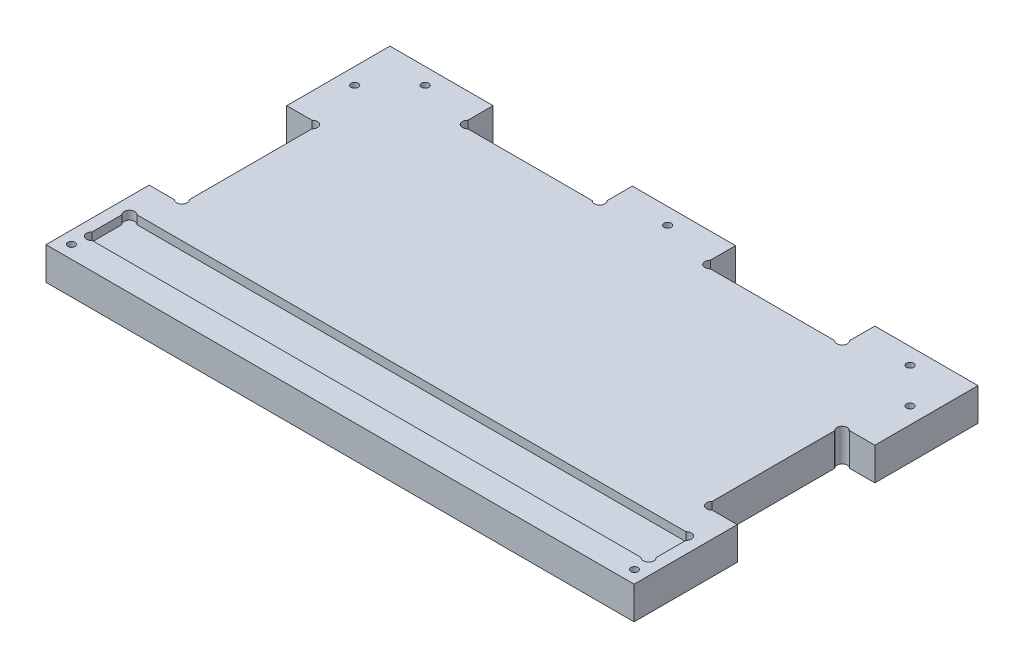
from build123d import *

# Parameters (mm, degrees)
ESQUISSE1_R        = 2.1
BOSS_EXTRU_1_DEPTH = 19
ESQUISSE2_W        = 333.917279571
ESQUISSE2_H        = 33.62448748
BOSS_EXTRU_2_DEPTH = 14


with BuildPart() as part:
    # Esquisse1 → Boss.-Extru.1 (new body)
    with BuildSketch(Plane(origin=(0, 0, 0), x_dir=(1, 0, 0), z_dir=(0, 1, 0))):
        with BuildLine():
            Line((0, 0), (342, 0))
            Line((342, 0), (342, 60))
            Line((342, 60), (327.311899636, 60))
            ThreePointArc((327.311899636, 60), (322.943324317, 59.943324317), (323, 64.311899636))
            Line((323, 64.311899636), (323, 135.688100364))
            ThreePointArc((323, 135.688100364), (322.943324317, 140.056675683), (327.311899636, 140))
            Line((327.311899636, 140), (342, 140))
            Line((342, 140), (342, 200))
            Line((342, 200), (282, 200))
            Line((282, 200), (282, 185.311899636))
            ThreePointArc((282, 185.311899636), (282.056675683, 180.943324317), (277.688100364, 181))
            Line((277.688100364, 181), (205.311899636, 181))
            ThreePointArc((205.311899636, 181), (200.943324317, 180.943324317), (201, 185.311899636))
            Line((201, 185.311899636), (201, 200))
            Line((201, 200), (141, 200))
            Line((141, 200), (141, 185.311899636))
            ThreePointArc((141, 185.311899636), (141.056675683, 180.943324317), (136.688100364, 181))
            Line((136.688100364, 181), (64.311899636, 181))
            ThreePointArc((64.311899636, 181), (59.943324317, 180.943324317), (60, 185.311899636))
            Line((60, 185.311899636), (60, 200))
            Line((60, 200), (0, 200))
            Line((0, 200), (0, 140))
            Line((0, 140), (14.688100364, 140))
            ThreePointArc((14.688100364, 140), (19.056675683, 140.056675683), (19, 135.688100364))
            Line((19, 135.688100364), (19, 64.311899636))
            ThreePointArc((19, 64.311899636), (19.056675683, 59.943324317), (14.688100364, 60))
            Line((14.688100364, 60), (0, 60))
            Line((0, 60), (0, 0))
        make_face()
        with Locations(Location((334.75, 7.5, 0), (0, 0, 270))):
            Circle(ESQUISSE1_R, mode=Mode.SUBTRACT)
        with Locations(Location((7.25, 7.5, 0), (0, 0, 90))):
            Circle(ESQUISSE1_R, mode=Mode.SUBTRACT)
        with Locations(Location((9.5, 170, 0), (0, 0, 270))):
            Circle(ESQUISSE1_R, mode=Mode.SUBTRACT)
        with Locations(Location((30, 190.5, 0), (0, 0, 270))):
            Circle(ESQUISSE1_R, mode=Mode.SUBTRACT)
        with Locations(Location((171, 190.5, 0), (0, 0, 270))):
            Circle(ESQUISSE1_R, mode=Mode.SUBTRACT)
        with Locations(Location((312, 190.5, 0), (0, 0, 90))):
            Circle(ESQUISSE1_R, mode=Mode.SUBTRACT)
        with Locations(Location((332.5, 170, 0), (0, 0, 90))):
            Circle(ESQUISSE1_R, mode=Mode.SUBTRACT)
        with BuildLine():
            Line((11.38035085, 41.5), (330.61964915, 41.5))
            ThreePointArc((330.61964915, 41.5), (335.092031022, 41.592031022), (335, 37.11964915))
            Line((335, 37.11964915), (335, 19.88035085))
            ThreePointArc((335, 19.88035085), (335.092031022, 15.407968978), (330.61964915, 15.5))
            Line((330.61964915, 15.5), (11.38035085, 15.5))
            ThreePointArc((11.38035085, 15.5), (6.907968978, 15.407968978), (7, 19.88035085))
            Line((7, 19.88035085), (7, 37.11964915))
            ThreePointArc((7, 37.11964915), (6.907968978, 41.592031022), (11.38035085, 41.5))
        make_face(mode=Mode.SUBTRACT)
    extrude(amount=-BOSS_EXTRU_1_DEPTH)

    # Esquisse2 → Boss.-Extru.2 (add)
    with BuildSketch(Plane.XZ.offset(19)):
        with Locations((171.643330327, -29.027333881)):
            Rectangle(ESQUISSE2_W, ESQUISSE2_H)
    extrude(amount=-BOSS_EXTRU_2_DEPTH)


solid = part.part
